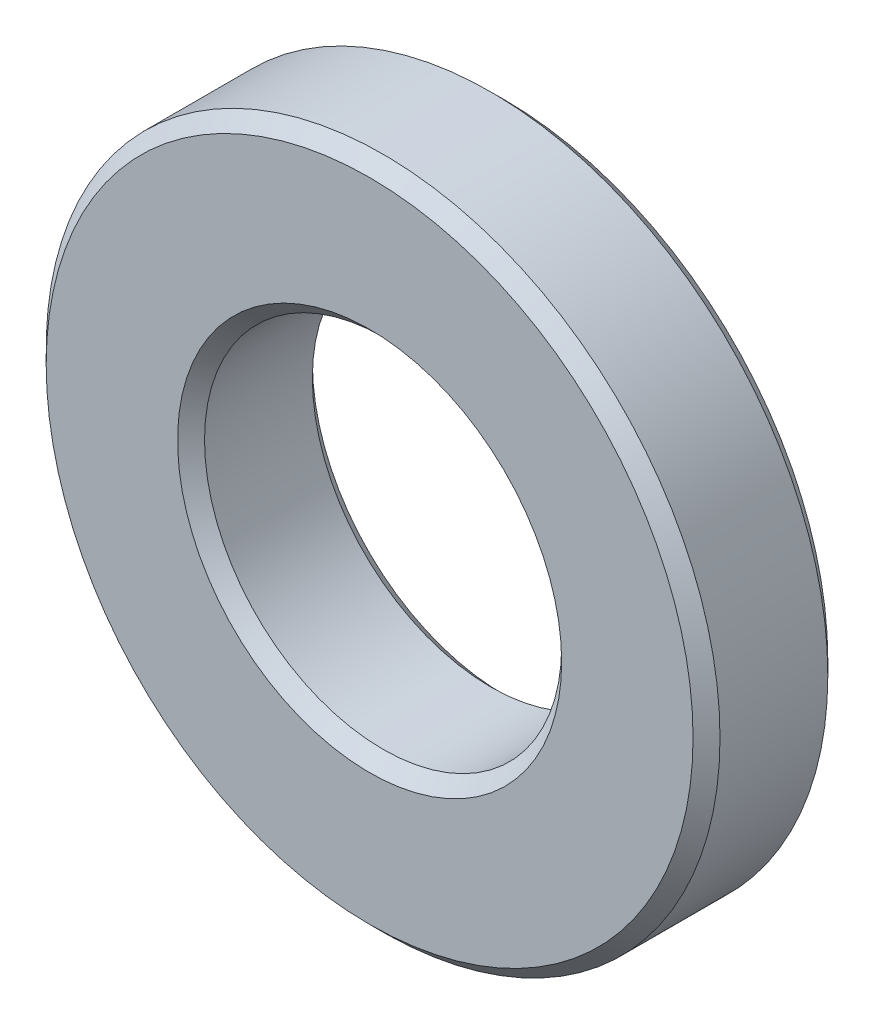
from build123d import *

# Parameters (mm, degrees)
SKETCH1_R           = 5
SKETCH1_R_2         = 2.65
BOSS_EXTRUDE2_DEPTH = 1
CHAMFER3_SIZE       = 0.2


with BuildPart() as part:
    # Sketch1 → Boss-Extrude2 (new, symmetric)
    with BuildSketch(Plane.XY):
        Circle(SKETCH1_R)
        Circle(SKETCH1_R_2, mode=Mode.SUBTRACT)
    extrude(amount=BOSS_EXTRUDE2_DEPTH, both=True)

    # Chamfer3
    chamfer3_edges = [part.edges().sort_by_distance(p)[0] for p in [
        (-5, 0, -1),
        (-5, 0, 1),
        (-2.65, 0, -1),
        (-2.65, 0, 1),
    ]]
    chamfer(chamfer3_edges, length=CHAMFER3_SIZE)


solid = part.part
